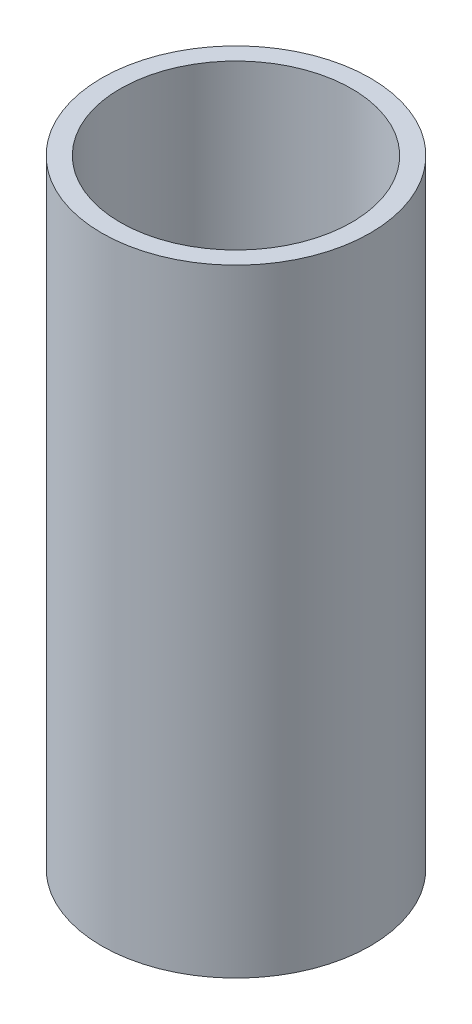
ISO-10303-21;
HEADER;
FILE_DESCRIPTION(('STEP AP214'),'2;1');
FILE_NAME('part.step','',(''),(''),'','','');
FILE_SCHEMA(('AUTOMOTIVE_DESIGN { 1 0 10303 214 1 1 1 1 }'));
ENDSEC;
DATA;
#1=APPLICATION_CONTEXT('core data for automotive mechanical design processes');
#2=APPLICATION_PROTOCOL_DEFINITION('international standard','automotive_design',2000,#1);
#3=PRODUCT_CONTEXT('',#1,'mechanical');
#4=PRODUCT('Part','Part','',(#3));
#5=PRODUCT_RELATED_PRODUCT_CATEGORY('part','',(#4));
#6=PRODUCT_DEFINITION_FORMATION('','',#4);
#7=PRODUCT_DEFINITION_CONTEXT('part definition',#1,'design');
#8=PRODUCT_DEFINITION('design','',#6,#7);
#9=PRODUCT_DEFINITION_SHAPE('','',#8);
#10=(LENGTH_UNIT() NAMED_UNIT(*) SI_UNIT(.MILLI.,.METRE.));
#11=(NAMED_UNIT(*) PLANE_ANGLE_UNIT() SI_UNIT($,.RADIAN.));
#12=(NAMED_UNIT(*) SI_UNIT($,.STERADIAN.) SOLID_ANGLE_UNIT());
#13=UNCERTAINTY_MEASURE_WITH_UNIT(LENGTH_MEASURE(1.E-05),#10,'distance_accuracy_value','');
#14=(GEOMETRIC_REPRESENTATION_CONTEXT(3) GLOBAL_UNCERTAINTY_ASSIGNED_CONTEXT((#13)) GLOBAL_UNIT_ASSIGNED_CONTEXT((#10,
#11,#12)) REPRESENTATION_CONTEXT('',''));
#15=CARTESIAN_POINT('',(0.,0.,0.));
#16=DIRECTION('',(0.,0.,1.));
#17=DIRECTION('',(1.,0.,0.));
#18=AXIS2_PLACEMENT_3D('',#15,#16,#17);
#19=CARTESIAN_POINT('',(0.,50.8,0.));
#20=DIRECTION('',(0.,1.,0.));
#21=DIRECTION('',(0.,0.,1.));
#22=AXIS2_PLACEMENT_3D('',#19,#20,#21);
#23=PLANE('',#22);
#24=CARTESIAN_POINT('',(0.,50.8,0.));
#25=DIRECTION('',(0.,1.,0.));
#26=DIRECTION('',(0.,0.,1.));
#27=AXIS2_PLACEMENT_3D('',#24,#25,#26);
#28=CIRCLE('',#27,22.098);
#29=CARTESIAN_POINT('',(0.,50.8,22.098));
#30=VERTEX_POINT('',#29);
#31=EDGE_CURVE('E10',#30,#30,#28,.T.);
#32=ORIENTED_EDGE('',*,*,#31,.T.);
#33=EDGE_LOOP('',(#32));
#34=FACE_BOUND('',#33,.T.);
#35=CARTESIAN_POINT('',(0.,50.8,0.));
#36=DIRECTION('',(0.,1.,0.));
#37=DIRECTION('',(0.,0.,1.));
#38=AXIS2_PLACEMENT_3D('',#35,#36,#37);
#39=CIRCLE('',#38,19.05);
#40=CARTESIAN_POINT('',(0.,50.8,19.05));
#41=VERTEX_POINT('',#40);
#42=EDGE_CURVE('E41',#41,#41,#39,.T.);
#43=ORIENTED_EDGE('',*,*,#42,.F.);
#44=EDGE_LOOP('',(#43));
#45=FACE_BOUND('',#44,.T.);
#46=ADVANCED_FACE('F30',(#34,#45),#23,.T.);
#47=CARTESIAN_POINT('',(0.,-50.8,0.));
#48=DIRECTION('',(0.,1.,0.));
#49=DIRECTION('',(0.,0.,1.));
#50=AXIS2_PLACEMENT_3D('',#47,#48,#49);
#51=PLANE('',#50);
#52=CARTESIAN_POINT('',(0.,-50.8,0.));
#53=DIRECTION('',(0.,1.,0.));
#54=DIRECTION('',(0.,0.,1.));
#55=AXIS2_PLACEMENT_3D('',#52,#53,#54);
#56=CIRCLE('',#55,22.098);
#57=CARTESIAN_POINT('',(0.,-50.8,22.098));
#58=VERTEX_POINT('',#57);
#59=EDGE_CURVE('E34',#58,#58,#56,.T.);
#60=ORIENTED_EDGE('',*,*,#59,.F.);
#61=EDGE_LOOP('',(#60));
#62=FACE_BOUND('',#61,.T.);
#63=CARTESIAN_POINT('',(0.,-50.8,0.));
#64=DIRECTION('',(0.,1.,0.));
#65=DIRECTION('',(0.,0.,1.));
#66=AXIS2_PLACEMENT_3D('',#63,#64,#65);
#67=CIRCLE('',#66,19.05);
#68=CARTESIAN_POINT('',(0.,-50.8,19.05));
#69=VERTEX_POINT('',#68);
#70=EDGE_CURVE('E43',#69,#69,#67,.T.);
#71=ORIENTED_EDGE('',*,*,#70,.T.);
#72=EDGE_LOOP('',(#71));
#73=FACE_BOUND('',#72,.T.);
#74=ADVANCED_FACE('F53',(#62,#73),#51,.F.);
#75=CARTESIAN_POINT('',(0.,50.8,0.));
#76=DIRECTION('',(0.,-1.,0.));
#77=DIRECTION('',(0.,0.,-1.));
#78=AXIS2_PLACEMENT_3D('',#75,#76,#77);
#79=CYLINDRICAL_SURFACE('',#78,22.098);
#80=ORIENTED_EDGE('',*,*,#31,.F.);
#81=EDGE_LOOP('',(#80));
#82=FACE_BOUND('',#81,.T.);
#83=ORIENTED_EDGE('',*,*,#59,.T.);
#84=EDGE_LOOP('',(#83));
#85=FACE_BOUND('',#84,.T.);
#86=ADVANCED_FACE('F32',(#82,#85),#79,.T.);
#87=CARTESIAN_POINT('',(0.,50.8,0.));
#88=DIRECTION('',(0.,-1.,0.));
#89=DIRECTION('',(0.,0.,-1.));
#90=AXIS2_PLACEMENT_3D('',#87,#88,#89);
#91=CYLINDRICAL_SURFACE('',#90,19.05);
#92=ORIENTED_EDGE('',*,*,#42,.T.);
#93=EDGE_LOOP('',(#92));
#94=FACE_BOUND('',#93,.T.);
#95=ORIENTED_EDGE('',*,*,#70,.F.);
#96=EDGE_LOOP('',(#95));
#97=FACE_BOUND('',#96,.T.);
#98=ADVANCED_FACE('F49',(#94,#97),#91,.F.);
#99=CLOSED_SHELL('',(#46,#74,#86,#98));
#100=MANIFOLD_SOLID_BREP('B2',#99);
#101=ADVANCED_BREP_SHAPE_REPRESENTATION('',(#18,#100),#14);
#102=SHAPE_DEFINITION_REPRESENTATION(#9,#101);
ENDSEC;
END-ISO-10303-21;
